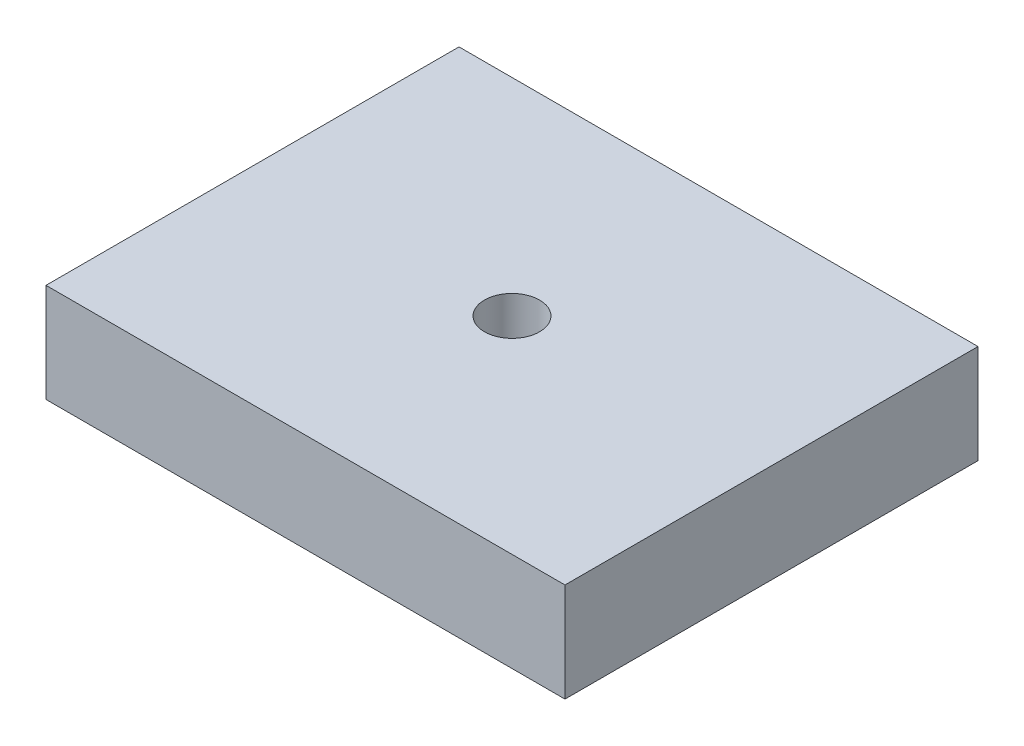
ISO-10303-21;
HEADER;
FILE_DESCRIPTION(('STEP AP214'),'2;1');
FILE_NAME('part.step','',(''),(''),'','','');
FILE_SCHEMA(('AUTOMOTIVE_DESIGN { 1 0 10303 214 1 1 1 1 }'));
ENDSEC;
DATA;
#1=APPLICATION_CONTEXT('core data for automotive mechanical design processes');
#2=APPLICATION_PROTOCOL_DEFINITION('international standard','automotive_design',2000,#1);
#3=PRODUCT_CONTEXT('',#1,'mechanical');
#4=PRODUCT('Part','Part','',(#3));
#5=PRODUCT_RELATED_PRODUCT_CATEGORY('part','',(#4));
#6=PRODUCT_DEFINITION_FORMATION('','',#4);
#7=PRODUCT_DEFINITION_CONTEXT('part definition',#1,'design');
#8=PRODUCT_DEFINITION('design','',#6,#7);
#9=PRODUCT_DEFINITION_SHAPE('','',#8);
#10=(LENGTH_UNIT() NAMED_UNIT(*) SI_UNIT(.MILLI.,.METRE.));
#11=(NAMED_UNIT(*) PLANE_ANGLE_UNIT() SI_UNIT($,.RADIAN.));
#12=(NAMED_UNIT(*) SI_UNIT($,.STERADIAN.) SOLID_ANGLE_UNIT());
#13=UNCERTAINTY_MEASURE_WITH_UNIT(LENGTH_MEASURE(1.E-05),#10,'distance_accuracy_value','');
#14=(GEOMETRIC_REPRESENTATION_CONTEXT(3) GLOBAL_UNCERTAINTY_ASSIGNED_CONTEXT((#13)) GLOBAL_UNIT_ASSIGNED_CONTEXT((#10,
#11,#12)) REPRESENTATION_CONTEXT('',''));
#15=CARTESIAN_POINT('',(0.,0.,0.));
#16=DIRECTION('',(0.,0.,1.));
#17=DIRECTION('',(1.,0.,0.));
#18=AXIS2_PLACEMENT_3D('',#15,#16,#17);
#19=CARTESIAN_POINT('',(-55.6692825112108,11.8470665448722,-37.9196562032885));
#20=DIRECTION('',(1.,0.,0.));
#21=DIRECTION('',(0.,0.,-1.));
#22=AXIS2_PLACEMENT_3D('',#19,#20,#21);
#23=PLANE('',#22);
#24=DIRECTION('',(0.,0.,1.));
#25=VECTOR('',#24,1.);
#26=CARTESIAN_POINT('',(-55.6692825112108,0.,-37.9196562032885));
#27=LINE('',#26,#25);
#28=CARTESIAN_POINT('',(-55.6692825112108,0.,-37.9196562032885));
#29=VERTEX_POINT('',#28);
#30=CARTESIAN_POINT('',(-55.6692825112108,0.,11.5673840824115));
#31=VERTEX_POINT('',#30);
#32=EDGE_CURVE('E98',#29,#31,#27,.T.);
#33=ORIENTED_EDGE('',*,*,#32,.T.);
#34=DIRECTION('',(0.,-1.,0.));
#35=VECTOR('',#34,1.);
#36=CARTESIAN_POINT('',(-55.6692825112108,11.8470665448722,11.5673840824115));
#37=LINE('',#36,#35);
#38=CARTESIAN_POINT('',(-55.6692825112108,11.8470665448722,11.5673840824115));
#39=VERTEX_POINT('',#38);
#40=EDGE_CURVE('E11',#39,#31,#37,.T.);
#41=ORIENTED_EDGE('',*,*,#40,.F.);
#42=DIRECTION('',(0.,0.,1.));
#43=VECTOR('',#42,1.);
#44=CARTESIAN_POINT('',(-55.6692825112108,11.8470665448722,-37.9196562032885));
#45=LINE('',#44,#43);
#46=CARTESIAN_POINT('',(-55.6692825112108,11.8470665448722,-37.9196562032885));
#47=VERTEX_POINT('',#46);
#48=EDGE_CURVE('E85',#47,#39,#45,.T.);
#49=ORIENTED_EDGE('',*,*,#48,.F.);
#50=DIRECTION('',(0.,-1.,0.));
#51=VECTOR('',#50,1.);
#52=CARTESIAN_POINT('',(-55.6692825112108,11.8470665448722,-37.9196562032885));
#53=LINE('',#52,#51);
#54=EDGE_CURVE('E94',#47,#29,#53,.T.);
#55=ORIENTED_EDGE('',*,*,#54,.T.);
#56=EDGE_LOOP('',(#33,#41,#49,#55));
#57=FACE_BOUND('',#56,.T.);
#58=ADVANCED_FACE('F33',(#57),#23,.F.);
#59=CARTESIAN_POINT('',(-55.6692825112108,11.8470665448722,11.5673840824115));
#60=DIRECTION('',(0.,0.,-1.));
#61=DIRECTION('',(-1.,0.,0.));
#62=AXIS2_PLACEMENT_3D('',#59,#60,#61);
#63=PLANE('',#62);
#64=DIRECTION('',(1.,0.,0.));
#65=VECTOR('',#64,1.);
#66=CARTESIAN_POINT('',(-55.6692825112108,0.,11.5673840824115));
#67=LINE('',#66,#65);
#68=CARTESIAN_POINT('',(6.51574588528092,0.,11.5673840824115));
#69=VERTEX_POINT('',#68);
#70=EDGE_CURVE('E89',#31,#69,#67,.T.);
#71=ORIENTED_EDGE('',*,*,#70,.T.);
#72=DIRECTION('',(0.,-1.,0.));
#73=VECTOR('',#72,1.);
#74=CARTESIAN_POINT('',(6.51574588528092,11.8470665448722,11.5673840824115));
#75=LINE('',#74,#73);
#76=CARTESIAN_POINT('',(6.51574588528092,11.8470665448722,11.5673840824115));
#77=VERTEX_POINT('',#76);
#78=EDGE_CURVE('E42',#77,#69,#75,.T.);
#79=ORIENTED_EDGE('',*,*,#78,.F.);
#80=DIRECTION('',(1.,0.,0.));
#81=VECTOR('',#80,1.);
#82=CARTESIAN_POINT('',(-55.6692825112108,11.8470665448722,11.5673840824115));
#83=LINE('',#82,#81);
#84=EDGE_CURVE('E80',#39,#77,#83,.T.);
#85=ORIENTED_EDGE('',*,*,#84,.F.);
#86=ORIENTED_EDGE('',*,*,#40,.T.);
#87=EDGE_LOOP('',(#71,#79,#85,#86));
#88=FACE_BOUND('',#87,.T.);
#89=ADVANCED_FACE('F88',(#88),#63,.F.);
#90=CARTESIAN_POINT('',(6.51574588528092,11.8470665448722,-37.9196562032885));
#91=DIRECTION('',(-1.,0.,0.));
#92=DIRECTION('',(0.,0.,1.));
#93=AXIS2_PLACEMENT_3D('',#90,#91,#92);
#94=PLANE('',#93);
#95=DIRECTION('',(0.,0.,-1.));
#96=VECTOR('',#95,1.);
#97=CARTESIAN_POINT('',(6.51574588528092,0.,-37.9196562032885));
#98=LINE('',#97,#96);
#99=CARTESIAN_POINT('',(6.51574588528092,0.,-37.9196562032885));
#100=VERTEX_POINT('',#99);
#101=EDGE_CURVE('E67',#69,#100,#98,.T.);
#102=ORIENTED_EDGE('',*,*,#101,.T.);
#103=DIRECTION('',(0.,-1.,0.));
#104=VECTOR('',#103,1.);
#105=CARTESIAN_POINT('',(6.51574588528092,11.8470665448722,-37.9196562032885));
#106=LINE('',#105,#104);
#107=CARTESIAN_POINT('',(6.51574588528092,11.8470665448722,-37.9196562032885));
#108=VERTEX_POINT('',#107);
#109=EDGE_CURVE('E90',#108,#100,#106,.T.);
#110=ORIENTED_EDGE('',*,*,#109,.F.);
#111=DIRECTION('',(0.,0.,-1.));
#112=VECTOR('',#111,1.);
#113=CARTESIAN_POINT('',(6.51574588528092,11.8470665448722,-37.9196562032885));
#114=LINE('',#113,#112);
#115=EDGE_CURVE('E83',#77,#108,#114,.T.);
#116=ORIENTED_EDGE('',*,*,#115,.F.);
#117=ORIENTED_EDGE('',*,*,#78,.T.);
#118=EDGE_LOOP('',(#102,#110,#116,#117));
#119=FACE_BOUND('',#118,.T.);
#120=ADVANCED_FACE('F92',(#119),#94,.F.);
#121=CARTESIAN_POINT('',(-55.6692825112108,11.8470665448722,-37.9196562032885));
#122=DIRECTION('',(0.,0.,1.));
#123=DIRECTION('',(1.,0.,0.));
#124=AXIS2_PLACEMENT_3D('',#121,#122,#123);
#125=PLANE('',#124);
#126=DIRECTION('',(-1.,0.,0.));
#127=VECTOR('',#126,1.);
#128=CARTESIAN_POINT('',(-55.6692825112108,0.,-37.9196562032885));
#129=LINE('',#128,#127);
#130=EDGE_CURVE('E73',#100,#29,#129,.T.);
#131=ORIENTED_EDGE('',*,*,#130,.T.);
#132=ORIENTED_EDGE('',*,*,#54,.F.);
#133=DIRECTION('',(-1.,0.,0.));
#134=VECTOR('',#133,1.);
#135=CARTESIAN_POINT('',(-55.6692825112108,11.8470665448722,-37.9196562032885));
#136=LINE('',#135,#134);
#137=EDGE_CURVE('E50',#108,#47,#136,.T.);
#138=ORIENTED_EDGE('',*,*,#137,.F.);
#139=ORIENTED_EDGE('',*,*,#109,.T.);
#140=EDGE_LOOP('',(#131,#132,#138,#139));
#141=FACE_BOUND('',#140,.T.);
#142=ADVANCED_FACE('F105',(#141),#125,.F.);
#143=CARTESIAN_POINT('',(-55.6692825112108,11.8470665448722,11.5673840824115));
#144=DIRECTION('',(0.,1.,0.));
#145=DIRECTION('',(0.,0.,1.));
#146=AXIS2_PLACEMENT_3D('',#143,#144,#145);
#147=PLANE('',#146);
#148=CARTESIAN_POINT('',(-24.5767683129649,11.8470665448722,-13.1761360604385));
#149=DIRECTION('',(0.,1.,0.));
#150=DIRECTION('',(0.,0.,1.));
#151=AXIS2_PLACEMENT_3D('',#148,#149,#150);
#152=CIRCLE('',#151,3.302);
#153=CARTESIAN_POINT('',(-24.5767683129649,11.8470665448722,-9.87413606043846));
#154=VERTEX_POINT('',#153);
#155=EDGE_CURVE('E111',#154,#154,#152,.T.);
#156=ORIENTED_EDGE('',*,*,#155,.F.);
#157=EDGE_LOOP('',(#156));
#158=FACE_BOUND('',#157,.T.);
#159=ORIENTED_EDGE('',*,*,#48,.T.);
#160=ORIENTED_EDGE('',*,*,#84,.T.);
#161=ORIENTED_EDGE('',*,*,#115,.T.);
#162=ORIENTED_EDGE('',*,*,#137,.T.);
#163=EDGE_LOOP('',(#159,#160,#161,#162));
#164=FACE_BOUND('',#163,.T.);
#165=ADVANCED_FACE('F81',(#158,#164),#147,.T.);
#166=CARTESIAN_POINT('',(-55.6692825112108,0.,11.5673840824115));
#167=DIRECTION('',(0.,1.,0.));
#168=DIRECTION('',(0.,0.,1.));
#169=AXIS2_PLACEMENT_3D('',#166,#167,#168);
#170=PLANE('',#169);
#171=CARTESIAN_POINT('',(-24.5767683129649,0.,-13.1761360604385));
#172=DIRECTION('',(0.,1.,0.));
#173=DIRECTION('',(0.,0.,1.));
#174=AXIS2_PLACEMENT_3D('',#171,#172,#173);
#175=CIRCLE('',#174,3.302);
#176=CARTESIAN_POINT('',(-24.5767683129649,0.,-9.87413606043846));
#177=VERTEX_POINT('',#176);
#178=EDGE_CURVE('E36',#177,#177,#175,.T.);
#179=ORIENTED_EDGE('',*,*,#178,.T.);
#180=EDGE_LOOP('',(#179));
#181=FACE_BOUND('',#180,.T.);
#182=ORIENTED_EDGE('',*,*,#32,.F.);
#183=ORIENTED_EDGE('',*,*,#130,.F.);
#184=ORIENTED_EDGE('',*,*,#101,.F.);
#185=ORIENTED_EDGE('',*,*,#70,.F.);
#186=EDGE_LOOP('',(#182,#183,#184,#185));
#187=FACE_BOUND('',#186,.T.);
#188=ADVANCED_FACE('F108',(#181,#187),#170,.F.);
#189=CARTESIAN_POINT('',(-24.5767683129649,-61.3049334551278,-13.1761360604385));
#190=DIRECTION('',(0.,1.,0.));
#191=DIRECTION('',(0.,0.,1.));
#192=AXIS2_PLACEMENT_3D('',#189,#190,#191);
#193=CYLINDRICAL_SURFACE('',#192,3.302);
#194=ORIENTED_EDGE('',*,*,#155,.T.);
#195=EDGE_LOOP('',(#194));
#196=FACE_BOUND('',#195,.T.);
#197=ORIENTED_EDGE('',*,*,#178,.F.);
#198=EDGE_LOOP('',(#197));
#199=FACE_BOUND('',#198,.T.);
#200=ADVANCED_FACE('F119',(#196,#199),#193,.F.);
#201=CLOSED_SHELL('',(#58,#89,#120,#142,#165,#188,#200));
#202=MANIFOLD_SOLID_BREP('B2',#201);
#203=ADVANCED_BREP_SHAPE_REPRESENTATION('',(#18,#202),#14);
#204=SHAPE_DEFINITION_REPRESENTATION(#9,#203);
ENDSEC;
END-ISO-10303-21;
